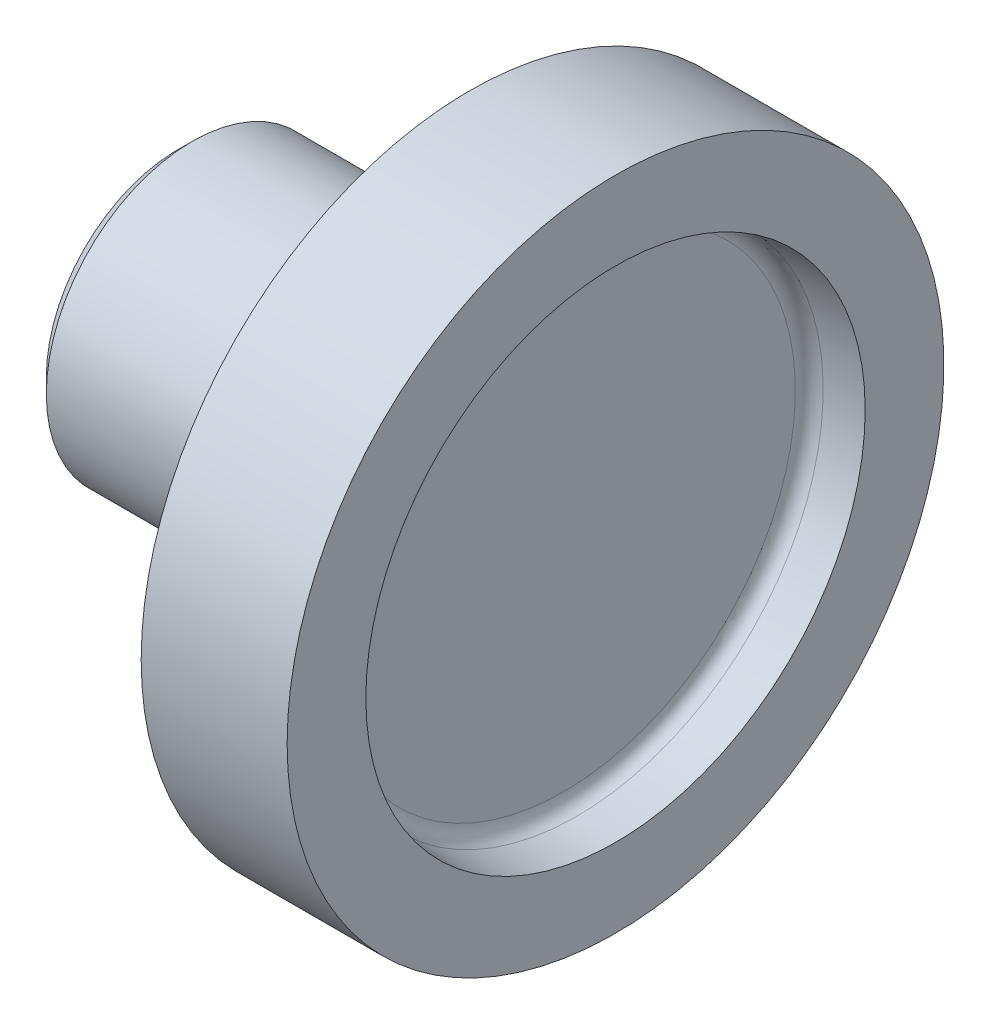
ISO-10303-21;
HEADER;
FILE_DESCRIPTION(('STEP AP214'),'2;1');
FILE_NAME('part.step','',(''),(''),'','','');
FILE_SCHEMA(('AUTOMOTIVE_DESIGN { 1 0 10303 214 1 1 1 1 }'));
ENDSEC;
DATA;
#1=APPLICATION_CONTEXT('core data for automotive mechanical design processes');
#2=APPLICATION_PROTOCOL_DEFINITION('international standard','automotive_design',2000,#1);
#3=PRODUCT_CONTEXT('',#1,'mechanical');
#4=PRODUCT('Part','Part','',(#3));
#5=PRODUCT_RELATED_PRODUCT_CATEGORY('part','',(#4));
#6=PRODUCT_DEFINITION_FORMATION('','',#4);
#7=PRODUCT_DEFINITION_CONTEXT('part definition',#1,'design');
#8=PRODUCT_DEFINITION('design','',#6,#7);
#9=PRODUCT_DEFINITION_SHAPE('','',#8);
#10=(LENGTH_UNIT() NAMED_UNIT(*) SI_UNIT(.MILLI.,.METRE.));
#11=(NAMED_UNIT(*) PLANE_ANGLE_UNIT() SI_UNIT($,.RADIAN.));
#12=(NAMED_UNIT(*) SI_UNIT($,.STERADIAN.) SOLID_ANGLE_UNIT());
#13=UNCERTAINTY_MEASURE_WITH_UNIT(LENGTH_MEASURE(1.E-05),#10,'distance_accuracy_value','');
#14=(GEOMETRIC_REPRESENTATION_CONTEXT(3) GLOBAL_UNCERTAINTY_ASSIGNED_CONTEXT((#13)) GLOBAL_UNIT_ASSIGNED_CONTEXT((#10,
#11,#12)) REPRESENTATION_CONTEXT('',''));
#15=CARTESIAN_POINT('',(0.,0.,0.));
#16=DIRECTION('',(0.,0.,1.));
#17=DIRECTION('',(1.,0.,0.));
#18=AXIS2_PLACEMENT_3D('',#15,#16,#17);
#19=CARTESIAN_POINT('',(3.11475449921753,15.8806688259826,0.));
#20=DIRECTION('',(-1.,0.,0.));
#21=DIRECTION('',(0.,0.,1.));
#22=AXIS2_PLACEMENT_3D('',#19,#20,#21);
#23=PLANE('',#22);
#24=CARTESIAN_POINT('',(3.11475449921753,0.,0.));
#25=DIRECTION('',(-1.,0.,0.));
#26=DIRECTION('',(0.,0.,1.));
#27=AXIS2_PLACEMENT_3D('',#24,#25,#26);
#28=CIRCLE('',#27,15.8806688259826);
#29=CARTESIAN_POINT('',(3.11475449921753,0.,15.8806688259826));
#30=VERTEX_POINT('',#29);
#31=EDGE_CURVE('E10',#30,#30,#28,.T.);
#32=ORIENTED_EDGE('',*,*,#31,.F.);
#33=EDGE_LOOP('',(#32));
#34=FACE_BOUND('',#33,.T.);
#35=ADVANCED_FACE('F35',(#34),#23,.F.);
#36=CARTESIAN_POINT('',(4.11475449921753,0.,0.));
#37=DIRECTION('',(-1.,0.,0.));
#38=DIRECTION('',(0.,0.,1.));
#39=AXIS2_PLACEMENT_3D('',#36,#37,#38);
#40=TOROIDAL_SURFACE('',#39,15.8806688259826,1.);
#41=CARTESIAN_POINT('',(4.02759875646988,0.,0.));
#42=DIRECTION('',(-1.,0.,0.));
#43=DIRECTION('',(0.,0.,1.));
#44=AXIS2_PLACEMENT_3D('',#41,#42,#43);
#45=CIRCLE('',#44,16.8768635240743);
#46=CARTESIAN_POINT('',(4.02759875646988,0.,16.8768635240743));
#47=VERTEX_POINT('',#46);
#48=EDGE_CURVE('E41',#47,#47,#45,.T.);
#49=ORIENTED_EDGE('',*,*,#48,.F.);
#50=EDGE_LOOP('',(#49));
#51=FACE_BOUND('',#50,.T.);
#52=ORIENTED_EDGE('',*,*,#31,.T.);
#53=EDGE_LOOP('',(#52));
#54=FACE_BOUND('',#53,.T.);
#55=ADVANCED_FACE('F101',(#51,#54),#40,.F.);
#56=CARTESIAN_POINT('',(4.02759875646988,0.,0.));
#57=DIRECTION('',(1.,0.,0.));
#58=DIRECTION('',(0.,0.,-1.));
#59=AXIS2_PLACEMENT_3D('',#56,#57,#58);
#60=CONICAL_SURFACE('',#59,16.8768635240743,0.0872664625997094);
#61=CARTESIAN_POINT('',(6.67475449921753,0.,0.));
#62=DIRECTION('',(-1.,0.,0.));
#63=DIRECTION('',(0.,0.,1.));
#64=AXIS2_PLACEMENT_3D('',#61,#62,#63);
#65=CIRCLE('',#64,17.1084596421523);
#66=CARTESIAN_POINT('',(6.67475449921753,0.,17.1084596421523));
#67=VERTEX_POINT('',#66);
#68=EDGE_CURVE('E45',#67,#67,#65,.T.);
#69=ORIENTED_EDGE('',*,*,#68,.F.);
#70=EDGE_LOOP('',(#69));
#71=FACE_BOUND('',#70,.T.);
#72=ORIENTED_EDGE('',*,*,#48,.T.);
#73=EDGE_LOOP('',(#72));
#74=FACE_BOUND('',#73,.T.);
#75=ADVANCED_FACE('F96',(#71,#74),#60,.F.);
#76=CARTESIAN_POINT('',(6.67475449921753,22.5,0.));
#77=DIRECTION('',(-1.,0.,0.));
#78=DIRECTION('',(0.,0.,1.));
#79=AXIS2_PLACEMENT_3D('',#76,#77,#78);
#80=PLANE('',#79);
#81=CARTESIAN_POINT('',(6.67475449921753,0.,0.));
#82=DIRECTION('',(-1.,0.,0.));
#83=DIRECTION('',(0.,0.,1.));
#84=AXIS2_PLACEMENT_3D('',#81,#82,#83);
#85=CIRCLE('',#84,22.5);
#86=CARTESIAN_POINT('',(6.67475449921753,0.,22.5));
#87=VERTEX_POINT('',#86);
#88=EDGE_CURVE('E49',#87,#87,#85,.T.);
#89=ORIENTED_EDGE('',*,*,#88,.F.);
#90=EDGE_LOOP('',(#89));
#91=FACE_BOUND('',#90,.T.);
#92=ORIENTED_EDGE('',*,*,#68,.T.);
#93=EDGE_LOOP('',(#92));
#94=FACE_BOUND('',#93,.T.);
#95=ADVANCED_FACE('F90',(#91,#94),#80,.F.);
#96=CARTESIAN_POINT('',(-50.3534379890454,0.,0.));
#97=DIRECTION('',(-1.,0.,0.));
#98=DIRECTION('',(0.,0.,1.));
#99=AXIS2_PLACEMENT_3D('',#96,#97,#98);
#100=CYLINDRICAL_SURFACE('',#99,22.5);
#101=CARTESIAN_POINT('',(-3.32524550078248,0.,0.));
#102=DIRECTION('',(-1.,0.,0.));
#103=DIRECTION('',(0.,0.,1.));
#104=AXIS2_PLACEMENT_3D('',#101,#102,#103);
#105=CIRCLE('',#104,22.5);
#106=CARTESIAN_POINT('',(-3.32524550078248,0.,22.5));
#107=VERTEX_POINT('',#106);
#108=EDGE_CURVE('E54',#107,#107,#105,.T.);
#109=ORIENTED_EDGE('',*,*,#108,.F.);
#110=EDGE_LOOP('',(#109));
#111=FACE_BOUND('',#110,.T.);
#112=ORIENTED_EDGE('',*,*,#88,.T.);
#113=EDGE_LOOP('',(#112));
#114=FACE_BOUND('',#113,.T.);
#115=ADVANCED_FACE('F84',(#111,#114),#100,.T.);
#116=CARTESIAN_POINT('',(-3.32524550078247,10.,0.));
#117=DIRECTION('',(1.,0.,0.));
#118=DIRECTION('',(0.,0.,-1.));
#119=AXIS2_PLACEMENT_3D('',#116,#117,#118);
#120=PLANE('',#119);
#121=CARTESIAN_POINT('',(-3.32524550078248,0.,0.));
#122=DIRECTION('',(-1.,0.,0.));
#123=DIRECTION('',(0.,0.,1.));
#124=AXIS2_PLACEMENT_3D('',#121,#122,#123);
#125=CIRCLE('',#124,10.);
#126=CARTESIAN_POINT('',(-3.32524550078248,0.,10.));
#127=VERTEX_POINT('',#126);
#128=EDGE_CURVE('E57',#127,#127,#125,.T.);
#129=ORIENTED_EDGE('',*,*,#128,.F.);
#130=EDGE_LOOP('',(#129));
#131=FACE_BOUND('',#130,.T.);
#132=ORIENTED_EDGE('',*,*,#108,.T.);
#133=EDGE_LOOP('',(#132));
#134=FACE_BOUND('',#133,.T.);
#135=ADVANCED_FACE('F78',(#131,#134),#120,.F.);
#136=CARTESIAN_POINT('',(-50.3534379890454,0.,0.));
#137=DIRECTION('',(-1.,0.,0.));
#138=DIRECTION('',(0.,0.,1.));
#139=AXIS2_PLACEMENT_3D('',#136,#137,#138);
#140=CYLINDRICAL_SURFACE('',#139,10.);
#141=CARTESIAN_POINT('',(-22.3252455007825,0.,0.));
#142=DIRECTION('',(-1.,0.,0.));
#143=DIRECTION('',(0.,0.,1.));
#144=AXIS2_PLACEMENT_3D('',#141,#142,#143);
#145=CIRCLE('',#144,10.);
#146=CARTESIAN_POINT('',(-22.3252455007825,0.,10.));
#147=VERTEX_POINT('',#146);
#148=EDGE_CURVE('E60',#147,#147,#145,.T.);
#149=ORIENTED_EDGE('',*,*,#148,.F.);
#150=EDGE_LOOP('',(#149));
#151=FACE_BOUND('',#150,.T.);
#152=ORIENTED_EDGE('',*,*,#128,.T.);
#153=EDGE_LOOP('',(#152));
#154=FACE_BOUND('',#153,.T.);
#155=ADVANCED_FACE('F72',(#151,#154),#140,.T.);
#156=CARTESIAN_POINT('',(-22.3252455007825,0.,0.));
#157=DIRECTION('',(1.,0.,0.));
#158=DIRECTION('',(0.,0.,-1.));
#159=AXIS2_PLACEMENT_3D('',#156,#157,#158);
#160=CONICAL_SURFACE('',#159,10.,0.785398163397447);
#161=CARTESIAN_POINT('',(-23.3252455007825,0.,0.));
#162=DIRECTION('',(-1.,0.,0.));
#163=DIRECTION('',(0.,0.,1.));
#164=AXIS2_PLACEMENT_3D('',#161,#162,#163);
#165=CIRCLE('',#164,9.);
#166=CARTESIAN_POINT('',(-23.3252455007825,0.,9.));
#167=VERTEX_POINT('',#166);
#168=EDGE_CURVE('E63',#167,#167,#165,.T.);
#169=ORIENTED_EDGE('',*,*,#168,.F.);
#170=EDGE_LOOP('',(#169));
#171=FACE_BOUND('',#170,.T.);
#172=ORIENTED_EDGE('',*,*,#148,.T.);
#173=EDGE_LOOP('',(#172));
#174=FACE_BOUND('',#173,.T.);
#175=ADVANCED_FACE('F69',(#171,#174),#160,.T.);
#176=CARTESIAN_POINT('',(-23.3252455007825,0.,0.));
#177=DIRECTION('',(1.,0.,0.));
#178=DIRECTION('',(0.,0.,-1.));
#179=AXIS2_PLACEMENT_3D('',#176,#177,#178);
#180=PLANE('',#179);
#181=ORIENTED_EDGE('',*,*,#168,.T.);
#182=EDGE_LOOP('',(#181));
#183=FACE_BOUND('',#182,.T.);
#184=ADVANCED_FACE('F67',(#183),#180,.F.);
#185=CLOSED_SHELL('',(#35,#55,#75,#95,#115,#135,#155,#175,#184));
#186=MANIFOLD_SOLID_BREP('B2',#185);
#187=ADVANCED_BREP_SHAPE_REPRESENTATION('',(#18,#186),#14);
#188=SHAPE_DEFINITION_REPRESENTATION(#9,#187);
ENDSEC;
END-ISO-10303-21;
